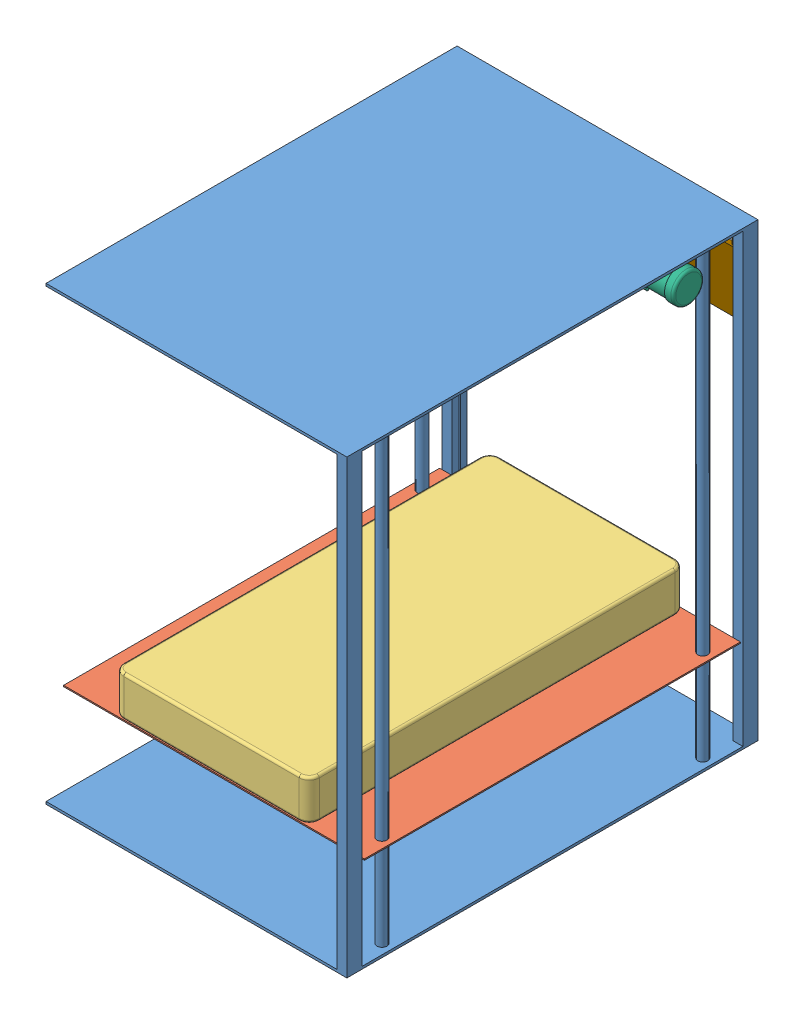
SolidWorks assembly assembly 1.SLDASM, configuration Default (file format 4700). Lengths in mm.
Overall size (1538.22 2286 2082.8).
26 component instances, 11 part files, 76 mates.
Components (placement in the parent):
- frame 1-1: frame 1.SLDPRT [Default] at origin size (1524 2286 2082.8)
- internal frame-1: internal frame.SLDPRT [Default] at (16.7774 471.6063 1908.722) size (1524 6.35 1905)
- mattress-1: mattress.SLDPRT [Default] at (691.9086 477.9563 1011.9181) x (0 0 -1) z (1 0 0) size (1905 203.2 990.6)
- pulleymountmitchell-1: pulleymountmitchell.SLDPRT [Default] at (69.6086 2283.4778 1888.7942) x (0 0 -1) z (-1 0 0) size (51.09 55.09 25.4)
- pulleymitchell-1: pulleymitchell.SLDPRT [Default] at (58.4961 2238.3341 1900.9181) x (0 -0.943655 0.330929) z (0 0.330929 0.943655) size (53.98 15.88 53.98)
- pulleymountmitchell-2: pulleymountmitchell.SLDPRT [Default] at (1365.0086 2283.4778 1888.7942) x (0 0 -1) z (-1 0 0) size (51.09 55.09 25.4)
- pulleymountmitchell-3: pulleymountmitchell.SLDPRT [Default] at (69.6086 2283.4778 23.4817) x (0 0 -1) z (-1 0 0) size (51.09 55.09 25.4)
- pulleymountmitchell-4: pulleymountmitchell.SLDPRT [Default] at (1339.6086 2283.4778 47.7296) x (0 0 1) z (1 0 0) size (51.09 55.09 25.4)
- pulleymitchell-2: pulleymitchell.SLDPRT [Default] at (58.4961 2238.3341 35.6056) x (0 -0.488104 0.872785) z (0 0.872785 0.488104) size (53.98 15.88 53.98)
- pulleymountmitchell-5: pulleymountmitchell.SLDPRT [Default] at (69.6086 2283.4778 47.7296) x (0 0 1) z (1 0 0) size (51.09 55.09 25.4)
- pulleymountmitchell-6: pulleymountmitchell.SLDPRT [Default] at (1339.6086 2283.4778 23.4817) x (0 0 -1) z (-1 0 0) size (51.09 55.09 25.4)
- motor-1: motor.SLDPRT [Default] at (1268.1076 2159.762 321.3556) x (-1 0 0) z (0 1 0) size (246.13 155.7 194.51)
- pulleymitchell-3: pulleymitchell.SLDPRT [Default] at (1328.4961 2238.3341 35.6056) x (0 -0.488104 0.872785) z (0 0.872785 0.488104) size (53.98 15.88 53.98)
- pulleymitchell-4: pulleymitchell.SLDPRT [Default] at (80.7211 2238.3341 35.6056) x (0 0.488104 -0.872785) z (0 0.872785 0.488104) size (53.98 15.88 53.98)
- pulleymitchell-5: pulleymitchell.SLDPRT [Default] at (1350.7211 2238.3341 35.6056) x (0 0.488104 -0.872785) z (0 0.872785 0.488104) size (53.98 15.88 53.98)
- pulleymitchell-6: pulleymitchell.SLDPRT [Default] at (1350.7211 2238.3341 1900.9181) x (0 1 0) z (0 0 1) size (53.98 15.88 53.98)
- driveshaft-1: driveshaft.SLDPRT [Default] at (704.6086 2238.3341 35.6056) x (1 0 0) z (0 0.488104 -0.872785) size (1320.8 12.5 12.7)
- key-2: key.SLDPRT [Default] at (1226.8326 2232.0171 33.8917) x (1 0 0) z (0 0.488104 -0.872785) size (12.7 6.35 3.17)
- key-3: key.SLDPRT [Default] at (1350.7211 2233.5668 31.1206) x (-1 0 0) z (0 -0.488104 0.872785) size (12.7 6.35 3.17)
- key-4: key.SLDPRT [Default] at (80.7211 2232.0171 33.8917) x (1 0 0) z (0 0.488104 -0.872785) size (12.7 6.35 3.17)
- key-5: key.SLDPRT [Default] at (1325.3211 2233.5668 31.1206) x (-1 0 0) z (0 -0.488104 0.872785) size (12.7 6.35 3.17)
- key-6: key.SLDPRT [Default] at (55.3211 2232.0171 33.8917) x (1 0 0) z (0 0.488104 -0.872785) size (12.7 6.35 3.17)
- counterweight-1: counterweight.SLDPRT [Default] at (1347.6808 1849.3478 5.4431) size (1447.8 342.9 25.4)
- sprocket-1: sprocket.SLDPRT [Default] at (1223.3909 2159.762 321.3556) x (0 -0.620639 0.784097) z (1 0 0) size (50.39 50.12 23.81)
- sprocket-2: sprocket.SLDPRT [Default] at (1223.3909 2238.3341 35.6056) x (0 -0.488104 0.872785) z (1 0 0) size (50.39 50.12 23.81)
- controls-2: controls.SLDPRT [Default] at (-57.3914 1342.4154 12.3957) x (0 0 1) z (-1 0 0) size (76.2 152.4 14.22)
Mates (geometry in assembly coordinates):
- Concentric1: concentric aligned: cylinder of frame 1-1 through (-6.5914 12.7 199.1181) axis (0 1 0) radius 25.4; cylinder of internal frame-1 through (-6.5914 452.5563 199.1181) axis (0 1 0) radius 25.4
- Concentric2: concentric aligned: cylinder of frame 1-1 through (1415.8086 12.7 1824.7181) axis (0 1 0) radius 25.4; cylinder of internal frame-1 through (1415.8086 452.5563 1824.7181) axis (0 1 0) radius 25.4
- Coincident1: coincident anti-aligned: plane of internal frame-1 through (-57.3914 477.9563 1964.4181) normal (0 1 0); plane of mattress-1 through (247.4086 477.9563 110.2181) normal (0 -1 0)
- Coincident2: coincident aligned: plane of internal frame-1 through (-57.3914 477.9563 1964.4181) normal (0 0 1); plane of mattress-1 through (1136.4086 681.1563 1964.4181) normal (0 0 1)
- Distance2: distance = 254 mm aligned: plane of internal frame-1 through (-57.3914 477.9563 59.4181) normal (-1 0 0); plane of mattress-1 through (196.6086 681.1563 1913.6181) normal (-1 0 0)
- Concentric3: concentric aligned: cylinder of pulleymountmitchell-1 through (85.1026 2238.3341 1900.9181) axis (-1 0 0) radius 6.35; cylinder of pulleymitchell-1 through (89.9921 2238.3341 1900.9181) axis (-1 0 0) radius 6.35
- Coincident5: coincident anti-aligned: plane of pulleymountmitchell-1 through (48.9711 2200.9278 1881.8681) normal (1 0 0); plane of pulleymitchell-1 through (48.9711 2238.3341 1900.9181) normal (-1 0 0)
- Coincident6: coincident anti-aligned: plane of frame 1-1 through (1466.6086 2273.3 2053.3181) normal (0 -1 0); plane of pulleymountmitchell-1 through (44.2086 2273.3 1875.5181) normal (0 1 0)
- Distance5: distance = 50.8 mm anti-aligned: plane of pulleymountmitchell-1 through (44.2086 2237.3029 1900.9181) normal (-1 0 0); plane of frame 1-1 through (-6.5914 12.7 1011.9181) normal (1 0 0)
- Coincident11: coincident aligned: plane of pulleymountmitchell-4 through (1365.0086 2273.3 61.0056) normal (0 1 0); plane of pulleymountmitchell-3 through (44.2086 2273.3 10.2056) normal (0 1 0)
- Coincident12: coincident: plane of pulleymountmitchell-4 through (1365.0086 2273.3 61.0056) normal (0 1 0); line of pulleymountmitchell-2 through (1339.6086 2273.3 1875.5181) axis (0 0 1)
- Coincident13: coincident aligned: plane of pulleymountmitchell-4 through (1365.0086 2273.3 61.0056) normal (0 1 0); plane of pulleymountmitchell-2 through (1339.6086 2273.3 1875.5181) normal (0 1 0)
- Coincident14: coincident anti-aligned: plane of pulleymountmitchell-4 through (1365.0086 2273.3 61.0056) normal (0 1 0); plane of frame 1-1 through (1466.6086 2273.3 2053.3181) normal (0 -1 0)
- Coincident15: coincident aligned: plane of pulleymountmitchell-3 through (44.2086 2237.3029 35.6056) normal (-1 0 0); plane of pulleymountmitchell-1 through (44.2086 2237.3029 1900.9181) normal (-1 0 0)
- Distance6: distance = 50.8 mm anti-aligned: plane of pulleymountmitchell-4 through (1365.0086 2237.3029 35.6056) normal (1 0 0); plane of frame 1-1 through (1415.8086 12.7 1011.9181) normal (-1 0 0)
- Coincident18: coincident aligned: plane of pulleymountmitchell-2 through (1339.6086 2237.3029 1900.9181) normal (-1 0 0); plane of pulleymountmitchell-4 through (1339.6086 2273.3 54.6556) normal (-1 0 0)
- Concentric4: concentric aligned: cylinder of pulleymountmitchell-2 through (1380.5026 2238.3341 1900.9181) axis (-1 0 0) radius 6.35; cylinder of pulleymitchell-1 through (89.9921 2238.3341 1900.9181) axis (-1 0 0) radius 6.35
- Concentric5: concentric anti-aligned: cylinder of pulleymountmitchell-3 through (85.1026 2238.3341 35.6056) axis (-1 0 0) radius 6.35; cylinder of pulleymountmitchell-4 through (1324.1146 2238.3341 35.6056) axis (1 0 0) radius 6.35
- Concentric6: concentric aligned: cylinder of pulleymountmitchell-3 through (85.1026 2238.3341 35.6056) axis (-1 0 0) radius 6.35; cylinder of pulleymitchell-2 through (89.9921 2238.3341 35.6056) axis (-1 0 0) radius 6.35
- Coincident19: coincident anti-aligned: plane of pulleymountmitchell-3 through (64.8461 2200.9278 54.6556) normal (-1 0 0); plane of pulleymitchell-2 through (64.8461 2238.3341 35.6056) normal (1 0 0)
- Distance7: distance = 4.7625 mm aligned: plane of assembly through (0 0 8.6181) normal (0 0 -1); cylinder of pulleymitchell-2 through (52.1461 2238.3341 35.6056) axis (1 0 0) radius 22.225
- Distance12: distance = 127 mm: plane of frame 1-1 through (-57.3914 2286 2053.3181) normal (0 0 1); line of pulleymountmitchell-1 through (44.2086 2273.3 1926.3181) axis (0 -1 0)
- Coincident23: coincident anti-aligned: plane of pulleymountmitchell-3 through (69.6086 2273.3 16.5556) normal (1 0 0); plane of pulleymountmitchell-5 through (69.6086 2273.3 54.6556) normal (-1 0 0)
- Concentric7: concentric anti-aligned: cylinder of pulleymountmitchell-3 through (85.1026 2238.3341 35.6056) axis (-1 0 0) radius 6.35; cylinder of pulleymountmitchell-5 through (54.1146 2238.3341 35.6056) axis (1 0 0) radius 6.35
- Concentric8: concentric anti-aligned: cylinder of pulleymountmitchell-5 through (54.1146 2238.3341 35.6056) axis (1 0 0) radius 6.35; cylinder of pulleymountmitchell-6 through (1355.1026 2238.3341 35.6056) axis (-1 0 0) radius 6.35
- Coincident24: coincident anti-aligned: plane of pulleymountmitchell-4 through (1339.6086 2273.3 54.6556) normal (-1 0 0); plane of pulleymountmitchell-6 through (1339.6086 2273.3 16.5556) normal (1 0 0)
- Coincident25: coincident anti-aligned: plane of frame 1-1 through (1466.6086 2273.3 2053.3181) normal (0 -1 0); plane of pulleymountmitchell-6 through (1314.2086 2273.3 10.2056) normal (0 1 0)
- Coincident26: coincident anti-aligned: plane of frame 1-1 through (1466.6086 2273.3 2053.3181) normal (0 -1 0); plane of pulleymountmitchell-5 through (95.0086 2273.3 61.0056) normal (0 1 0)
- Coincident27: coincident aligned: plane of motor-1 through (1466.6086 2159.762 321.3556) normal (1 0 0); plane of frame 1-1 through (1466.6086 2286 -29.4819) normal (1 0 0)
- Coincident28: coincident anti-aligned: plane of frame 1-1 through (1466.6086 2273.3 2053.3181) normal (0 -1 0); plane of motor-1 through (1415.4276 2273.3 356.1536) normal (0 1 0)
- Distance13: distance = 228.6 mm anti-aligned: plane of motor-1 through (1415.4276 2269.236 283.2556) normal (0 0 -1); plane of pulleymountmitchell-6 through (1314.2086 2266.95 54.6556) normal (0 0 1)
- Concentric9: concentric anti-aligned: cylinder of pulleymitchell-4 through (49.2251 2238.3341 35.6056) axis (1 0 0) radius 6.35; cylinder of pulleymitchell-3 through (1359.9921 2238.3341 35.6056) axis (-1 0 0) radius 6.35
- Concentric10: concentric aligned: cylinder of pulleymitchell-4 through (49.2251 2238.3341 35.6056) axis (1 0 0) radius 6.35; cylinder of pulleymitchell-5 through (1319.2251 2238.3341 35.6056) axis (1 0 0) radius 6.35
- Concentric11: concentric anti-aligned: cylinder of pulleymountmitchell-5 through (54.1146 2238.3341 35.6056) axis (1 0 0) radius 6.35; cylinder of pulleymitchell-3 through (1359.9921 2238.3341 35.6056) axis (-1 0 0) radius 6.35
- Coincident31: coincident anti-aligned: plane of pulleymountmitchell-5 through (90.2461 2200.9278 54.6556) normal (-1 0 0); plane of pulleymitchell-4 through (90.2461 2238.3341 35.6056) normal (1 0 0)
- Coincident32: coincident anti-aligned: plane of pulleymountmitchell-4 through (1360.2461 2200.9278 54.6556) normal (-1 0 0); plane of pulleymitchell-5 through (1360.2461 2238.3341 35.6056) normal (1 0 0)
- Coincident35: coincident anti-aligned: plane of pulleymountmitchell-6 through (1318.9711 2200.9278 16.5556) normal (1 0 0); plane of pulleymitchell-3 through (1318.9711 2238.3341 35.6056) normal (-1 0 0)
- Coincident36: coincident anti-aligned: plane of pulleymountmitchell-2 through (1344.3711 2200.9278 1881.8681) normal (1 0 0); plane of pulleymitchell-6 through (1344.3711 2238.3341 1900.9181) normal (-1 0 0)
- Concentric12: concentric anti-aligned: cylinder of pulleymountmitchell-2 through (1380.5026 2238.3341 1900.9181) axis (-1 0 0) radius 6.35; cylinder of pulleymitchell-6 through (1319.2251 2238.3341 1900.9181) axis (1 0 0) radius 6.35
- Concentric13: concentric aligned: cylinder of pulleymountmitchell-6 through (1355.1026 2238.3341 35.6056) axis (-1 0 0) radius 6.35; cylinder of driveshaft-1 through (1365.0086 2238.3341 35.6056) axis (-1 0 0) radius 6.35
- Coincident37: coincident aligned: plane of pulleymountmitchell-3 through (44.2086 2237.3029 35.6056) normal (-1 0 0); plane of driveshaft-1 through (44.2086 2238.3341 35.6056) normal (-1 0 0)
- Coincident38: coincident aligned: plane of pulleymountmitchell-3 through (44.2086 2237.3029 35.6056) normal (-1 0 0); plane of driveshaft-1 through (44.2086 2238.3341 35.6056) normal (-1 0 0)
- Coincident42: coincident anti-aligned: line of pulleymitchell-2 through (48.9711 2230.7957 29.5709) axis (1 0 0); line of key-6 through (61.6711 2230.7957 29.5709) axis (-1 0 0)
- Coincident43: coincident anti-aligned: plane of pulleymitchell-2 through (48.9711 2230.7957 29.5709) normal (0 0.872785 0.488104); plane of key-6 through (48.9711 2230.7957 29.5709) normal (0 -0.872785 -0.488104)
- Coincident44: coincident aligned: plane of pulleymitchell-2 through (48.9711 2238.3341 35.6056) normal (-1 0 0); plane of key-6 through (48.9711 2236.3379 32.6704) normal (-1 0 0)
- Coincident46: coincident anti-aligned: plane of driveshaft-1 through (1365.0086 2233.7428 31.2191) normal (0 -0.488104 0.872785); plane of key-6 through (61.6711 2230.7957 29.5709) normal (0 0.488104 -0.872785)
- Coincident48: coincident aligned: plane of key-5 through (1318.9711 2229.246 32.342) normal (0 -0.488104 0.872785); plane of key-3 through (1344.3711 2229.246 32.342) normal (0 -0.488104 0.872785)
- Coincident50: coincident anti-aligned: plane of key-5 through (1318.9711 2229.246 32.342) normal (0 -0.488104 0.872785); plane of driveshaft-1 through (1365.0086 2232.1931 33.9901) normal (0 0.488104 -0.872785)
- Coincident52: coincident aligned: plane of key-3 through (1357.0711 2234.7882 35.4415) normal (0 0.872785 0.488104); plane of key-5 through (1331.6711 2234.7882 35.4415) normal (0 0.872785 0.488104)
- Coincident53: coincident aligned: plane of key-3 through (1357.0711 2234.7882 35.4415) normal (0 0.872785 0.488104); plane of key-4 through (74.3711 2236.3379 32.6704) normal (0 0.872785 0.488104)
- Coincident54: coincident anti-aligned: plane of key-3 through (1357.0711 2234.7882 35.4415) normal (0 0.872785 0.488104); plane of driveshaft-1 through (1365.0086 2236.3379 32.6704) normal (0 -0.872785 -0.488104)
- Coincident55: coincident aligned: plane of pulleymitchell-4 through (74.3711 2238.3341 35.6056) normal (-1 0 0); plane of key-4 through (74.3711 2236.3379 32.6704) normal (-1 0 0)
- Coincident60: coincident: plane of key-3 through (1344.3711 2230.7957 29.5709) normal (0 0.488104 -0.872785); line of key-4 through (74.3711 2230.7957 29.5709) axis (0 0.872785 0.488104)
- Coincident62: coincident anti-aligned: plane of pulleymitchell-4 through (90.2461 2233.5668 31.1206) normal (0 -0.488104 0.872785); plane of key-4 through (87.0711 2230.7957 29.5709) normal (0 0.488104 -0.872785)
- Coincident63: coincident anti-aligned: plane of pulleymitchell-3 through (1318.9711 2232.0171 33.8917) normal (0 0.488104 -0.872785); plane of key-5 through (1318.9711 2229.246 32.342) normal (0 -0.488104 0.872785)
- Coincident65: coincident aligned: plane of pulleymitchell-3 through (1318.9711 2238.3341 35.6056) normal (-1 0 0); plane of key-5 through (1318.9711 2234.7882 35.4415) normal (-1 0 0)
- Coincident66: coincident aligned: plane of pulleymitchell-5 through (1344.3711 2238.3341 35.6056) normal (-1 0 0); plane of key-3 through (1344.3711 2234.7882 35.4415) normal (-1 0 0)
- Coincident67: coincident anti-aligned: plane of pulleymitchell-5 through (1360.2461 2232.0171 33.8917) normal (0 0.488104 -0.872785); plane of key-3 through (1344.3711 2229.246 32.342) normal (0 -0.488104 0.872785)
- Coincident68: coincident anti-aligned: plane of driveshaft-1 through (1365.0086 2233.7428 31.2191) normal (0 -0.488104 0.872785); plane of key-2 through (1233.1826 2230.7957 29.5709) normal (0 0.488104 -0.872785)
- Coincident69: coincident anti-aligned: plane of driveshaft-1 through (1365.0086 2236.3379 32.6704) normal (0 -0.872785 -0.488104); plane of key-2 through (1220.4826 2236.3379 32.6704) normal (0 0.872785 0.488104)
- Coincident71: coincident anti-aligned: plane of frame 1-1 through (-1302.9396 12.7 11.7931) normal (0 0 -1); plane of counterweight-1 through (1428.5086 2154.1478 11.7931) normal (0 0 1)
- Distance15: distance = 12.7 mm anti-aligned: plane of frame 1-1 through (-6.5914 12.7 1011.9181) normal (1 0 0); plane of counterweight-1 through (6.1086 2154.1478 11.7931) normal (-1 0 0)
- Distance16: distance = 609.6 mm aligned: plane of mattress-1 through (247.4086 622.3 110.2181) normal (0 1 0); plane of frame 1-1 through (-1302.9396 12.7 1011.9181) normal (0 1 0)
- RackPinionMate1: rack pinion = 44.45 mm: line of counterweight-1 through (6.1086 2154.1478 21.3181) axis (0 -1 0); circle of pulleymitchell-2
- GearMate1: gear = 53.975 mm: circle of pulleymitchell-2; circle of pulleymitchell-1
- RackPinionMate2: rack pinion = 44.45 mm: line of internal frame-1 through (-57.3914 477.9563 1964.4181) axis (0 -1 0); circle of pulleymitchell-1
- Concentric14: concentric anti-aligned: cylinder of motor-1 through (1278.2633 2159.762 321.3556) axis (1 0 0) radius 7.9375; cylinder of sprocket-1 through (1214.8057 2159.762 321.3556) axis (-1 0 0) radius 6.35
- Coincident72: coincident aligned: plane of motor-1 through (1220.4826 2159.762 321.3556) normal (-1 0 0); plane of sprocket-1 through (1220.4826 2154.783 317.4146) normal (-1 0 0)
- Concentric15: concentric aligned: cylinder of driveshaft-1 through (1365.0086 2238.3341 35.6056) axis (-1 0 0) radius 6.35; cylinder of sprocket-2 through (1214.8057 2238.3341 35.6056) axis (-1 0 0) radius 6.35
- Coincident73: coincident aligned: plane of sprocket-1 through (1221.2446 2154.783 317.4146) normal (-1 0 0); plane of sprocket-2 through (1221.2446 2232.7919 32.5062) normal (-1 0 0)
- Coincident74: coincident aligned: plane of driveshaft-1 through (1365.0086 2233.7428 31.2191) normal (0 -0.488104 0.872785); plane of sprocket-2 through (1244.2951 2233.5668 31.1206) normal (0 -0.488104 0.872785)
- Coincident75: coincident aligned: plane of key-2 through (1220.4826 2236.3379 32.6704) normal (-1 0 0); plane of sprocket-2 through (1220.4826 2232.7919 32.5062) normal (-1 0 0)
- GearMate2: gear = 34.5281 mm: circle of sprocket-2; circle of sprocket-1
- Coincident76: coincident anti-aligned: plane of frame 1-1 through (-57.3914 2286 -29.4819) normal (-1 0 0); plane of controls-2 through (-57.3914 1219.2 -29.4819) normal (1 0 0)
- Coincident77: coincident aligned: plane of frame 1-1 through (-57.3914 2286 -29.4819) normal (0 0 -1); plane of controls-2 through (-70.0914 1371.6 -29.4819) normal (0 0 -1)
- Distance17: distance = 1219.2 mm aligned: plane of controls-2 through (-70.0914 1219.2 -29.4819) normal (0 -1 0); plane of frame 1-1 through (-57.3914 0 2053.3181) normal (0 -1 0)
